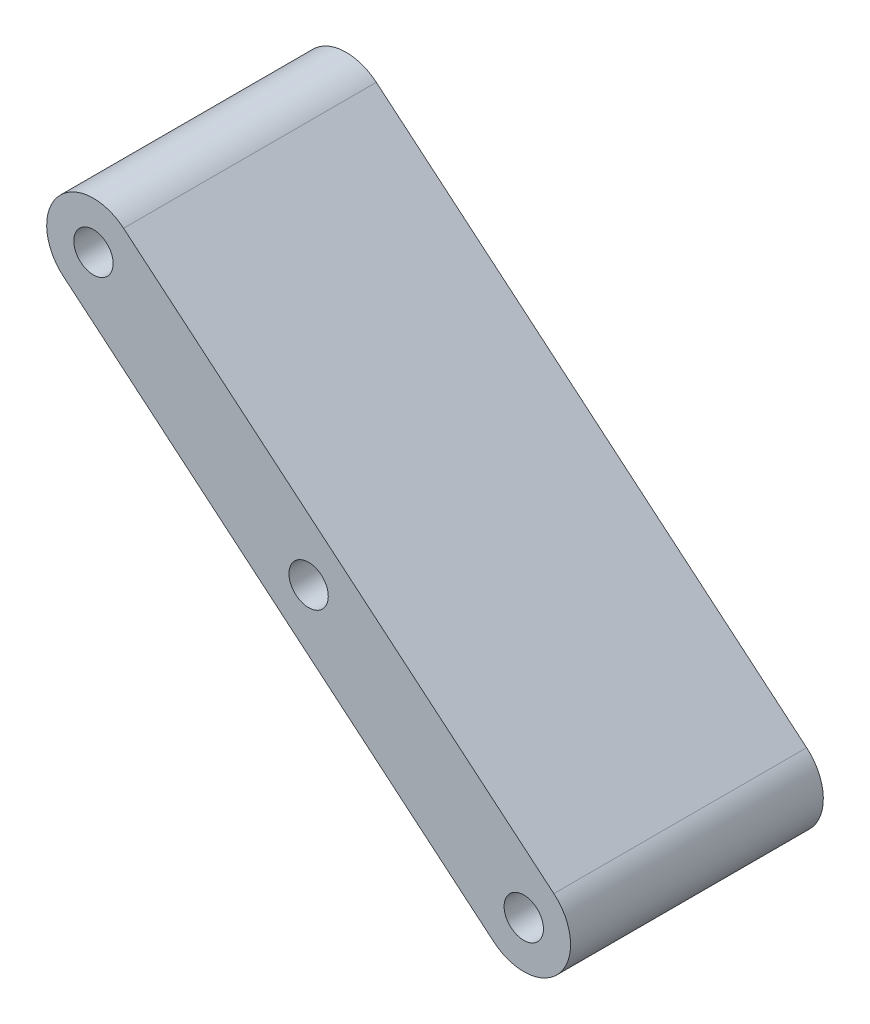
from build123d import *

# Parameters (mm, degrees)
SKETCH1_R           = 2.1
BOSS_EXTRUDE1_DEPTH = 27


with BuildPart() as part:
    # Sketch1 → Boss-Extrude1 (new body)
    with BuildSketch(Plane.XY.offset(10)):
        with BuildLine():
            Line((44.663839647, -44.004447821), (90.626506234, -82.571704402))
            ThreePointArc((90.626506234, -82.571704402), (97.670666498, -81.955420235), (97.054382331, -74.911259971))
            Line((97.054382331, -74.911259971), (51.091715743, -36.34400339))
            ThreePointArc((51.091715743, -36.34400339), (44.047555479, -36.960287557), (44.663839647, -44.004447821))
        make_face()
        with Locations((47.877777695, -40.174225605)):
            Circle(SKETCH1_R, mode=Mode.SUBTRACT)
        with Locations((70.859110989, -59.457853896)):
            Circle(SKETCH1_R, mode=Mode.SUBTRACT)
        with Locations((93.840444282, -78.741482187)):
            Circle(SKETCH1_R, mode=Mode.SUBTRACT)
    extrude(amount=BOSS_EXTRUDE1_DEPTH)


solid = part.part
